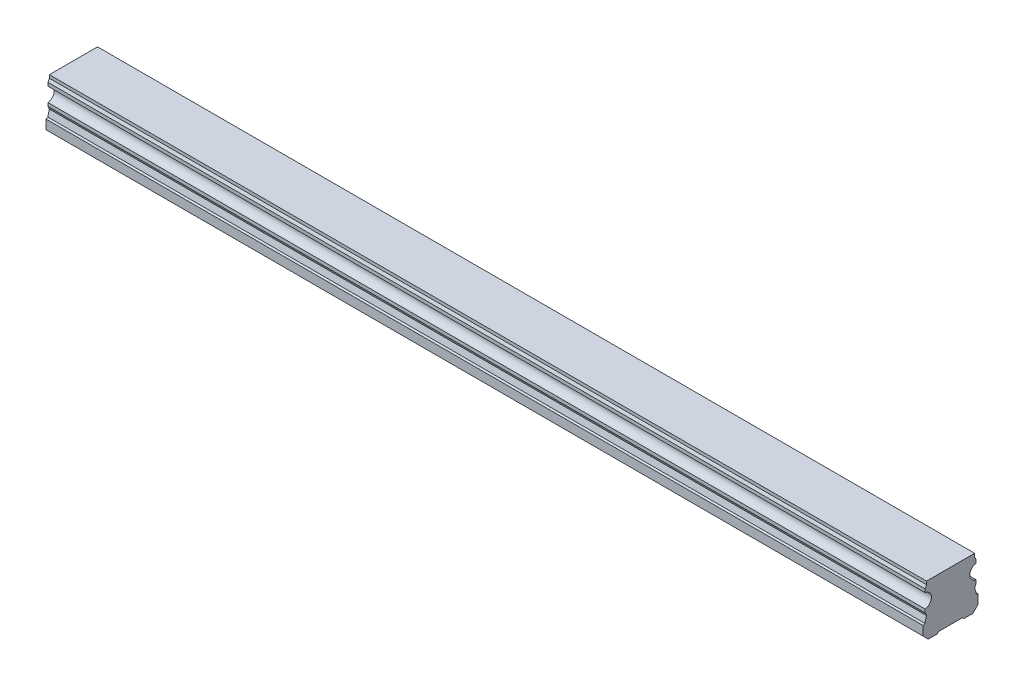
from build123d import *

# Parameters (mm, degrees)
BOSS_EXTRUDE1_DEPTH        = 240
SKETCH3_R                  = 2.5
SKETCH3_R_2                = 2.1
CUT_EXTRUDE3_DEPTH         = 7
SKETCH3_2_R                = 2.1
CUT_EXTRUDE4_DEPTH         = 9.5
CHAMFER1_SIZE              = 0.4
LPATTERN2_COUNT            = 4
LPATTERN2_PITCH            = 60
CHAMFER1_OF_LPATTERN2_SIZE = 0.4


with BuildPart() as part:
    # Sketch1 → Boss-Extrude1 (new body)
    with BuildSketch(Plane(origin=(0, 0, 0), x_dir=(0, 0, -1), z_dir=(1, 0, 0))):
        with BuildLine():
            Line((6.59, 14), (-6.59, 14))
            Line((-6.59, 14), (-6.59, 13.15))
            Line((-6.59, 13.15), (-6.96, 12.356532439))
            Line((-6.96, 12.356532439), (-6.96, 11.435174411))
            ThreePointArc((-6.96, 11.435174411), (-5.25, 9.5), (-6.96, 7.564825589))
            Line((-6.96, 7.564825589), (-6.96, 6.643467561))
            Line((-6.96, 6.643467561), (-6.59, 5.85))
            Line((-6.59, 5.85), (-7.032116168, 4.2))
            Line((-7.032116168, 4.2), (-7.5, 3.929867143))
            Line((-7.5, 3.929867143), (-7.5, 1.4))
            Line((-7.5, 1.4), (-6.1, 0))
            Line((-6.1, 0), (-3.65, 0))
            Line((-3.65, 0), (-3.25, 0.4))
            Line((-3.25, 0.4), (3.25, 0.4))
            Line((3.25, 0.4), (3.65, 0))
            Line((3.65, 0), (6.1, 0))
            Line((6.1, 0), (7.5, 1.4))
            Line((7.5, 1.4), (7.5, 3.929867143))
            Line((7.5, 3.929867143), (7.032116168, 4.2))
            Line((7.032116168, 4.2), (6.59, 5.85))
            Line((6.59, 5.85), (6.96, 6.643467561))
            Line((6.96, 6.643467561), (6.96, 7.564825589))
            ThreePointArc((6.96, 7.564825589), (5.25, 9.5), (6.96, 11.435174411))
            Line((6.96, 11.435174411), (6.96, 12.356532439))
            Line((6.96, 12.356532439), (6.59, 13.15))
            Line((6.59, 13.15), (6.59, 14))
        make_face()
    extrude(amount=BOSS_EXTRUDE1_DEPTH)

    # Sketch3 → Cut-Extrude3 (cut)
    with BuildSketch(Plane.XZ):
        with Locations(Location((30, 0, 0), (0, 0, 270))):
            Circle(SKETCH3_R)
        with Locations(Location((30, 0, 0), (0, 0, 270))):
            Circle(SKETCH3_R_2, mode=Mode.SUBTRACT)
    cut_extrude3 = extrude(amount=-CUT_EXTRUDE3_DEPTH, mode=Mode.SUBTRACT)

    # Sketch3_2 → Cut-Extrude4 (cut)
    with BuildSketch(Plane.XZ):
        with Locations(Location((30, 0, 0), (0, 0, 270))):
            Circle(SKETCH3_2_R)
    cut_extrude4 = extrude(amount=-CUT_EXTRUDE4_DEPTH, mode=Mode.SUBTRACT)

    # Cut-Extrude5 cone 1 section (on through the dimple's axis) → Cut-Extrude5 (revolve, cut)
    with BuildSketch(Plane(origin=(30, 9.5, 0), x_dir=(0, 0, -1), z_dir=(1, 0, 0))):
        Polygon((0, 0), (2.1, 0), (0, 1.212435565), align=None)
    revolve(axis=Axis((30, 9.5, 0), (0, 1, 0)), mode=Mode.SUBTRACT)

    # Chamfer1
    chamfer1_edges = [part.edges().sort_by_distance(p)[0] for p in [
        (30, 0.4, 2.5),
    ]]
    chamfer(chamfer1_edges, length=CHAMFER1_SIZE)

    # LPattern2: Cut-Extrude3, Cut-Extrude4 ×4
    with Locations(*[(i * LPATTERN2_PITCH, 0, 0) for i in range(1, LPATTERN2_COUNT)]):
        add(cut_extrude3, mode=Mode.SUBTRACT)
        add(cut_extrude4, mode=Mode.SUBTRACT)

    # Chamfer1 of LPattern2
    chamfer1_of_lpattern2_edges = [part.edges().sort_by_distance(p)[0] for p in [
        (90, 0.4, 2.5),
        (150, 0.4, 2.5),
        (210, 0.4, 2.5),
    ]]
    chamfer(chamfer1_of_lpattern2_edges, length=CHAMFER1_OF_LPATTERN2_SIZE)


solid = part.part
